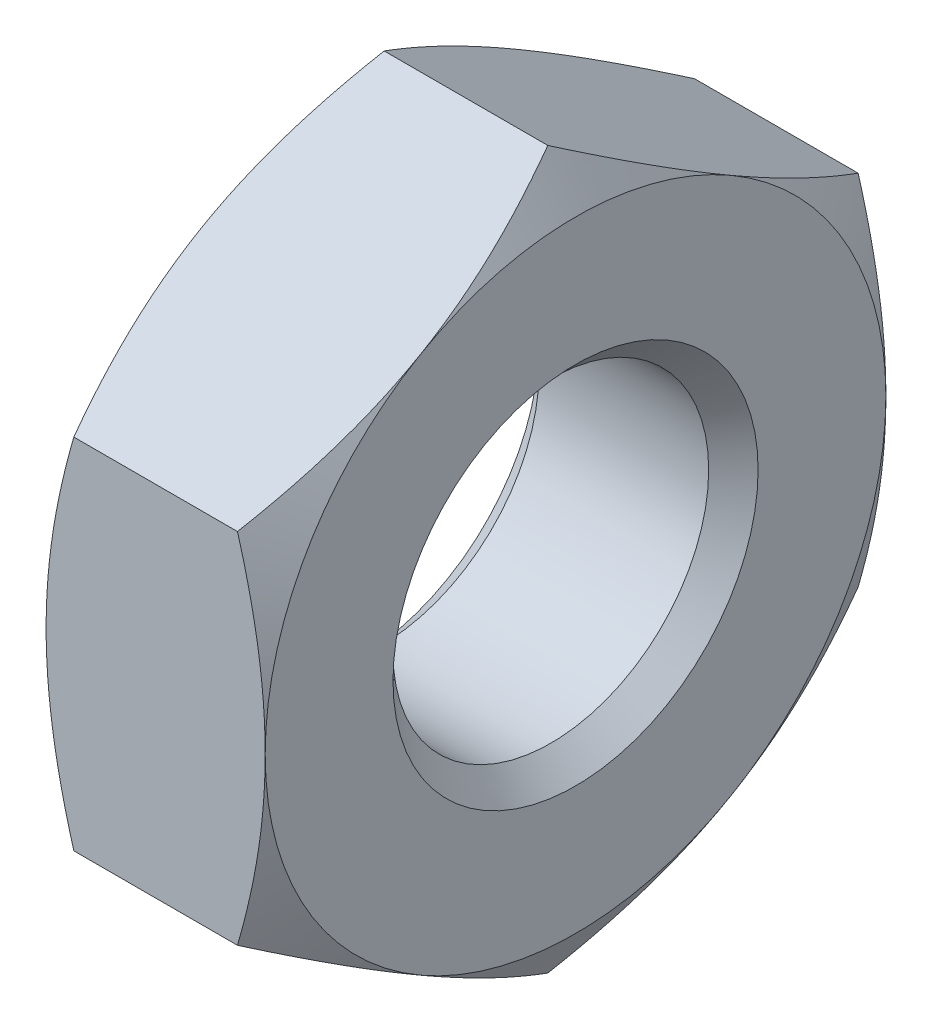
ISO-10303-21;
HEADER;
FILE_DESCRIPTION(('STEP AP214'),'2;1');
FILE_NAME('part.step','',(''),(''),'','','');
FILE_SCHEMA(('AUTOMOTIVE_DESIGN { 1 0 10303 214 1 1 1 1 }'));
ENDSEC;
DATA;
#1=APPLICATION_CONTEXT('core data for automotive mechanical design processes');
#2=APPLICATION_PROTOCOL_DEFINITION('international standard','automotive_design',2000,#1);
#3=PRODUCT_CONTEXT('',#1,'mechanical');
#4=PRODUCT('Part','Part','',(#3));
#5=PRODUCT_RELATED_PRODUCT_CATEGORY('part','',(#4));
#6=PRODUCT_DEFINITION_FORMATION('','',#4);
#7=PRODUCT_DEFINITION_CONTEXT('part definition',#1,'design');
#8=PRODUCT_DEFINITION('design','',#6,#7);
#9=PRODUCT_DEFINITION_SHAPE('','',#8);
#10=(LENGTH_UNIT() NAMED_UNIT(*) SI_UNIT(.MILLI.,.METRE.));
#11=(NAMED_UNIT(*) PLANE_ANGLE_UNIT() SI_UNIT($,.RADIAN.));
#12=(NAMED_UNIT(*) SI_UNIT($,.STERADIAN.) SOLID_ANGLE_UNIT());
#13=UNCERTAINTY_MEASURE_WITH_UNIT(LENGTH_MEASURE(1.E-05),#10,'distance_accuracy_value','');
#14=(GEOMETRIC_REPRESENTATION_CONTEXT(3) GLOBAL_UNCERTAINTY_ASSIGNED_CONTEXT((#13)) GLOBAL_UNIT_ASSIGNED_CONTEXT((#10,
#11,#12)) REPRESENTATION_CONTEXT('',''));
#15=CARTESIAN_POINT('',(0.,0.,0.));
#16=DIRECTION('',(0.,0.,1.));
#17=DIRECTION('',(1.,0.,0.));
#18=AXIS2_PLACEMENT_3D('',#15,#16,#17);
#19=CARTESIAN_POINT('',(-2.01850454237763,0.,0.));
#20=DIRECTION('',(1.,0.,0.));
#21=DIRECTION('',(0.,0.,-1.));
#22=AXIS2_PLACEMENT_3D('',#19,#20,#21);
#23=CONICAL_SURFACE('',#22,10.2,1.0471975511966);
#24=CARTESIAN_POINT('',(1.08239963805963,-13.0462125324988,-8.5));
#25=CARTESIAN_POINT('',(0.903402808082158,-12.6760798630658,-8.5));
#26=CARTESIAN_POINT('',(0.726162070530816,-12.3050827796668,-8.5));
#27=CARTESIAN_POINT('',(0.37618329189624,-11.5608995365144,-8.5));
#28=CARTESIAN_POINT('',(0.203445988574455,-11.1877130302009,-8.5));
#29=CARTESIAN_POINT('',(-0.137433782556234,-10.4367018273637,-8.5));
#30=CARTESIAN_POINT('',(-0.305544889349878,-10.0588628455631,-8.5));
#31=CARTESIAN_POINT('',(-0.634703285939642,-9.30013174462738,-8.5));
#32=CARTESIAN_POINT('',(-0.795750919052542,-8.91923977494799,-8.5));
#33=CARTESIAN_POINT('',(-1.11372395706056,-8.14203709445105,-8.5));
#34=CARTESIAN_POINT('',(-1.27037118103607,-7.74561192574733,-8.5));
#35=CARTESIAN_POINT('',(-1.5714775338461,-6.94807471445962,-8.5));
#36=CARTESIAN_POINT('',(-1.71593527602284,-6.54696214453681,-8.5));
#37=CARTESIAN_POINT('',(-1.98876984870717,-5.74020294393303,-8.5));
#38=CARTESIAN_POINT('',(-2.11718044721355,-5.33456785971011,-8.5));
#39=CARTESIAN_POINT('',(-2.35371296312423,-4.51749645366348,-8.5));
#40=CARTESIAN_POINT('',(-2.46184141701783,-4.10606204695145,-8.5));
#41=CARTESIAN_POINT('',(-2.65195658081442,-3.27934683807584,-8.5));
#42=CARTESIAN_POINT('',(-2.73407986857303,-2.86409832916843,-8.5));
#43=CARTESIAN_POINT('',(-2.83413907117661,-2.23755533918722,-8.5));
#44=CARTESIAN_POINT('',(-2.86363924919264,-2.02807949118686,-8.5));
#45=CARTESIAN_POINT('',(-2.91434957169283,-1.60813347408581,-8.5));
#46=CARTESIAN_POINT('',(-2.93556051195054,-1.39766340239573,-8.5));
#47=CARTESIAN_POINT('',(-2.96901070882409,-0.978699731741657,-8.5));
#48=CARTESIAN_POINT('',(-2.98136051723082,-0.770214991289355,-8.5));
#49=CARTESIAN_POINT('',(-2.99724292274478,-0.35291057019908,-8.5));
#50=CARTESIAN_POINT('',(-3.00077566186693,-0.14409089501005,-8.5));
#51=CARTESIAN_POINT('',(-2.99893991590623,0.273511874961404,-8.5));
#52=CARTESIAN_POINT('',(-2.99357135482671,0.482294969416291,-8.5));
#53=CARTESIAN_POINT('',(-2.97406159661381,0.899453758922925,-8.5));
#54=CARTESIAN_POINT('',(-2.95991996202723,1.10782943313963,-8.5));
#55=CARTESIAN_POINT('',(-2.91531216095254,1.61281865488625,-8.5));
#56=CARTESIAN_POINT('',(-2.88045071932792,1.90905045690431,-8.5));
#57=CARTESIAN_POINT('',(-2.79492946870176,2.49922657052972,-8.5));
#58=CARTESIAN_POINT('',(-2.74426739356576,2.79317054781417,-8.5));
#59=CARTESIAN_POINT('',(-2.62894743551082,3.37852184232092,-8.5));
#60=CARTESIAN_POINT('',(-2.56427821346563,3.66992690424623,-8.5));
#61=CARTESIAN_POINT('',(-2.42290936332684,4.2497709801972,-8.5));
#62=CARTESIAN_POINT('',(-2.34620995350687,4.53821004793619,-8.5));
#63=CARTESIAN_POINT('',(-2.18085440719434,5.11836420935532,-8.5));
#64=CARTESIAN_POINT('',(-2.0919757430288,5.41001544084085,-8.5));
#65=CARTESIAN_POINT('',(-1.90532998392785,5.99044389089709,-8.5));
#66=CARTESIAN_POINT('',(-1.8075628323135,6.27922109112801,-8.5));
#67=CARTESIAN_POINT('',(-1.60466641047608,6.85404914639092,-8.5));
#68=CARTESIAN_POINT('',(-1.49953978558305,7.14010093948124,-8.5));
#69=CARTESIAN_POINT('',(-1.28313214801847,7.7098543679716,-8.5));
#70=CARTESIAN_POINT('',(-1.1718511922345,7.99355602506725,-8.5));
#71=CARTESIAN_POINT('',(-0.912449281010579,8.63761346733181,-8.5));
#72=CARTESIAN_POINT('',(-0.762699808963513,8.99731216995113,-8.5));
#73=CARTESIAN_POINT('',(-0.456504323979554,9.71385543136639,-8.5));
#74=CARTESIAN_POINT('',(-0.30005798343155,10.0706998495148,-8.5));
#75=CARTESIAN_POINT('',(0.0182565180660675,10.7820346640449,-8.5));
#76=CARTESIAN_POINT('',(0.180125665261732,11.1365246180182,-8.5));
#77=CARTESIAN_POINT('',(0.50824875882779,11.8434580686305,-8.5));
#78=CARTESIAN_POINT('',(0.674502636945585,12.1959015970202,-8.5));
#79=CARTESIAN_POINT('',(1.01076024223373,12.8993735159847,-8.5));
#80=CARTESIAN_POINT('',(1.18076713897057,13.2504003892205,-8.5));
#81=CARTESIAN_POINT('',(1.52377741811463,13.9509882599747,-8.5));
#82=CARTESIAN_POINT('',(1.69678082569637,14.3005492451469,-8.5));
#83=CARTESIAN_POINT('',(2.21953102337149,15.347382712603,-8.5));
#84=CARTESIAN_POINT('',(2.5730111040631,16.0427918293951,-8.5));
#85=CARTESIAN_POINT('',(3.09465466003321,17.0561246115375,-8.5));
#86=CARTESIAN_POINT('',(3.26001892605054,17.3754981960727,-8.5));
#87=CARTESIAN_POINT('',(3.59207124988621,18.0135502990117,-8.5));
#88=CARTESIAN_POINT('',(3.75875928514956,18.3322288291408,-8.5));
#89=CARTESIAN_POINT('',(4.26055818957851,19.2873817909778,-8.5));
#90=CARTESIAN_POINT('',(4.59739214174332,19.9229508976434,-8.5));
#91=CARTESIAN_POINT('',(5.273843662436,21.190807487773,-8.5));
#92=CARTESIAN_POINT('',(5.61345347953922,21.8230991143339,-8.5));
#93=CARTESIAN_POINT('',(6.29546476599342,23.0861357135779,-8.5));
#94=CARTESIAN_POINT('',(6.63786609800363,23.7168807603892,-8.5));
#95=CARTESIAN_POINT('',(6.98131927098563,24.3470488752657,-8.5));
#96=B_SPLINE_CURVE_WITH_KNOTS('',3,(#24,#25,#26,#27,#28,#29,#30,#31,#32,#33,#34,#35,#36,#37,#38,
#39,#40,#41,#42,#43,#44,#45,#46,#47,#48,#49,#50,#51,#52,#53,#54,#55,#56,#57,#58,#59,#60,#61,#62,
#63,#64,#65,#66,#67,#68,#69,#70,#71,#72,#73,#74,#75,#76,#77,#78,#79,#80,#81,#82,#83,#84,#85,#86,
#87,#88,#89,#90,#91,#92,#93,#94,#95),.UNSPECIFIED.,.F.,.F.,(4,2,2,2,2,2,2,2,2,2,2,2,2,2,2,2,2,2,
2,2,2,2,2,2,2,2,2,2,2,2,2,2,2,2,2,4),(0.,1.23344288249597,2.46708657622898,3.70767886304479,
4.94821078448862,6.22681310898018,7.50556068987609,8.78157039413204,10.0571681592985,
11.3259509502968,11.9604413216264,12.5948707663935,13.2212405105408,13.8476001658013,
14.4739651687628,15.1003614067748,15.9946915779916,16.8891500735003,17.7843353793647,
18.679504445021,19.5940140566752,20.5085295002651,21.4227178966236,22.3368978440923,
23.5056849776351,24.6745293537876,25.8435874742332,27.0126274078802,28.1826955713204,
29.3527735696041,31.6929757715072,32.7719109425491,33.8508277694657,36.0087380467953,
38.1619023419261,40.3149613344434),.UNSPECIFIED.);
#97=CARTESIAN_POINT('',(-2.24081062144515,-4.90747728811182,-8.5));
#98=VERTEX_POINT('',#97);
#99=CARTESIAN_POINT('',(-3.,0.,-8.5));
#100=VERTEX_POINT('',#99);
#101=EDGE_CURVE('E333',#98,#100,#96,.T.);
#102=ORIENTED_EDGE('',*,*,#101,.F.);
#103=CARTESIAN_POINT('',(-2.24074395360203,-9.81507004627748,0.000200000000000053));
#104=CARTESIAN_POINT('',(-2.30301386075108,-9.70719836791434,-0.186639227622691));
#105=CARTESIAN_POINT('',(-2.36245770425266,-9.59892450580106,-0.374175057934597));
#106=CARTESIAN_POINT('',(-2.47491488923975,-9.3814974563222,-0.750769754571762));
#107=CARTESIAN_POINT('',(-2.52792545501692,-9.27234391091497,-0.939829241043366));
#108=CARTESIAN_POINT('',(-2.67626661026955,-8.94313560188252,-1.5100347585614));
#109=CARTESIAN_POINT('',(-2.76064107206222,-8.72178130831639,-1.89343164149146));
#110=CARTESIAN_POINT('',(-2.85957998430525,-8.39052888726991,-2.46717766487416));
#111=CARTESIAN_POINT('',(-2.88776480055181,-8.28162036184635,-2.65581276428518));
#112=CARTESIAN_POINT('',(-2.9350259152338,-8.06331079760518,-3.03393602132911));
#113=CARTESIAN_POINT('',(-2.95410301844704,-7.95390980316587,-3.22342410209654));
#114=CARTESIAN_POINT('',(-2.9826652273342,-7.73491944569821,-3.6027265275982));
#115=CARTESIAN_POINT('',(-2.99216121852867,-7.62533043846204,-3.79254025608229));
#116=CARTESIAN_POINT('',(-3.00135762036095,-7.40605119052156,-4.17234305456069));
#117=CARTESIAN_POINT('',(-3.00105833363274,-7.29636095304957,-4.36233211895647));
#118=CARTESIAN_POINT('',(-2.9913455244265,-7.09129139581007,-4.71752301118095));
#119=CARTESIAN_POINT('',(-2.98311683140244,-6.99589760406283,-4.8827499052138));
#120=CARTESIAN_POINT('',(-2.95941075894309,-6.80533344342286,-5.21281671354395));
#121=CARTESIAN_POINT('',(-2.9439328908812,-6.71016309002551,-5.37765660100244));
#122=CARTESIAN_POINT('',(-2.88699137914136,-6.42502047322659,-5.87153810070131));
#123=CARTESIAN_POINT('',(-2.83502693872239,-6.23555293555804,-6.19970550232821));
#124=CARTESIAN_POINT('',(-2.70511505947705,-5.8546080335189,-6.85952142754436));
#125=CARTESIAN_POINT('',(-2.62661693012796,-5.66317928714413,-7.19108574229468));
#126=CARTESIAN_POINT('',(-2.44845866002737,-5.28317649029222,-7.84926989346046));
#127=CARTESIAN_POINT('',(-2.34884036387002,-5.09459757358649,-8.17589815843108));
#128=CARTESIAN_POINT('',(-2.24074395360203,-4.90736181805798,-8.5002));
#129=B_SPLINE_CURVE_WITH_KNOTS('',3,(#103,#104,#105,#106,#107,#108,#109,#110,#111,#112,#113,
#114,#115,#116,#117,#118,#119,#120,#121,#122,#123,#124,#125,#126,#127,#128),.UNSPECIFIED.,.F.,
.F.,(4,2,2,2,2,2,2,2,2,2,2,2,4),(0.,0.673596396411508,1.34748239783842,2.69805431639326,
3.356799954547,4.01548737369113,4.67342558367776,5.33134346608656,5.9040955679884,
6.47688628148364,7.62328361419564,8.79510569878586,9.9646274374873),.UNSPECIFIED.);
#130=CARTESIAN_POINT('',(-3.,-7.36121593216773,-4.25));
#131=VERTEX_POINT('',#130);
#132=EDGE_CURVE('E168',#131,#98,#129,.T.);
#133=ORIENTED_EDGE('',*,*,#132,.F.);
#134=CARTESIAN_POINT('',(-3.,0.,0.));
#135=DIRECTION('',(-1.,0.,0.));
#136=DIRECTION('',(0.,0.,1.));
#137=AXIS2_PLACEMENT_3D('',#134,#135,#136);
#138=CIRCLE('',#137,8.5);
#139=EDGE_CURVE('E324',#100,#131,#138,.T.);
#140=ORIENTED_EDGE('',*,*,#139,.F.);
#141=EDGE_LOOP('',(#102,#133,#140));
#142=FACE_BOUND('',#141,.T.);
#143=ADVANCED_FACE('F16',(#142),#23,.T.);
#144=CARTESIAN_POINT('',(-2.24081062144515,4.90747728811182,-8.5));
#145=VERTEX_POINT('',#144);
#146=EDGE_CURVE('E176',#100,#145,#96,.T.);
#147=ORIENTED_EDGE('',*,*,#146,.F.);
#148=CARTESIAN_POINT('',(-3.,7.36121593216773,-4.25));
#149=VERTEX_POINT('',#148);
#150=EDGE_CURVE('E325',#149,#100,#138,.T.);
#151=ORIENTED_EDGE('',*,*,#150,.F.);
#152=CARTESIAN_POINT('',(-2.24074395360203,4.90736181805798,-8.5002));
#153=CARTESIAN_POINT('',(-2.30301386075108,5.01523349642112,-8.31336077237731));
#154=CARTESIAN_POINT('',(-2.36245770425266,5.1235073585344,-8.1258249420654));
#155=CARTESIAN_POINT('',(-2.47491488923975,5.34093440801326,-7.74923024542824));
#156=CARTESIAN_POINT('',(-2.52792545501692,5.45008795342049,-7.56017075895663));
#157=CARTESIAN_POINT('',(-2.67626661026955,5.77929626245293,-6.9899652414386));
#158=CARTESIAN_POINT('',(-2.76064107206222,6.00065055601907,-6.60656835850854));
#159=CARTESIAN_POINT('',(-2.85957998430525,6.33190297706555,-6.03282233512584));
#160=CARTESIAN_POINT('',(-2.8877648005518,6.44081150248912,-5.84418723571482));
#161=CARTESIAN_POINT('',(-2.9350259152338,6.65912106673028,-5.46606397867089));
#162=CARTESIAN_POINT('',(-2.95410301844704,6.76852206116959,-5.27657589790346));
#163=CARTESIAN_POINT('',(-2.9826652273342,6.98751241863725,-4.8972734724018));
#164=CARTESIAN_POINT('',(-2.99216121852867,7.09710142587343,-4.70745974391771));
#165=CARTESIAN_POINT('',(-3.00135762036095,7.3163806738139,-4.32765694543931));
#166=CARTESIAN_POINT('',(-3.00105833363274,7.42607091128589,-4.13766788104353));
#167=CARTESIAN_POINT('',(-2.9913455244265,7.63114046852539,-3.78247698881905));
#168=CARTESIAN_POINT('',(-2.98311683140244,7.72653426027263,-3.6172500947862));
#169=CARTESIAN_POINT('',(-2.95941075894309,7.9170984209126,-3.28718328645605));
#170=CARTESIAN_POINT('',(-2.9439328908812,8.01226877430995,-3.12234339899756));
#171=CARTESIAN_POINT('',(-2.88699137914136,8.29741139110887,-2.62846189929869));
#172=CARTESIAN_POINT('',(-2.83502693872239,8.48687892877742,-2.30029449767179));
#173=CARTESIAN_POINT('',(-2.70511505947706,8.86782383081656,-1.64047857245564));
#174=CARTESIAN_POINT('',(-2.62661693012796,9.05925257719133,-1.30891425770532));
#175=CARTESIAN_POINT('',(-2.44845866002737,9.43925537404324,-0.650730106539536));
#176=CARTESIAN_POINT('',(-2.34884036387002,9.62783429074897,-0.32410184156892));
#177=CARTESIAN_POINT('',(-2.24074395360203,9.81507004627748,0.000200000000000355));
#178=B_SPLINE_CURVE_WITH_KNOTS('',3,(#152,#153,#154,#155,#156,#157,#158,#159,#160,#161,#162,
#163,#164,#165,#166,#167,#168,#169,#170,#171,#172,#173,#174,#175,#176,#177),.UNSPECIFIED.,.F.,
.F.,(4,2,2,2,2,2,2,2,2,2,2,2,4),(0.,0.673596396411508,1.34748239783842,2.69805431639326,
3.356799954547,4.01548737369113,4.67342558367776,5.33134346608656,5.9040955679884,
6.47688628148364,7.62328361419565,8.79510569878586,9.96462743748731),.UNSPECIFIED.);
#179=EDGE_CURVE('E191',#145,#149,#178,.T.);
#180=ORIENTED_EDGE('',*,*,#179,.F.);
#181=EDGE_LOOP('',(#147,#151,#180));
#182=FACE_BOUND('',#181,.T.);
#183=ADVANCED_FACE('F150',(#182),#23,.T.);
#184=CARTESIAN_POINT('',(-2.24081062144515,9.81495457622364,0.));
#185=VERTEX_POINT('',#184);
#186=EDGE_CURVE('E184',#149,#185,#178,.T.);
#187=ORIENTED_EDGE('',*,*,#186,.F.);
#188=CARTESIAN_POINT('',(-3.,7.36121593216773,4.25));
#189=VERTEX_POINT('',#188);
#190=EDGE_CURVE('E24',#189,#149,#138,.T.);
#191=ORIENTED_EDGE('',*,*,#190,.F.);
#192=CARTESIAN_POINT('',(-2.24074395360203,9.81507004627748,-0.000200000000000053));
#193=CARTESIAN_POINT('',(-2.30301386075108,9.70719836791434,0.186639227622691));
#194=CARTESIAN_POINT('',(-2.36245770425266,9.59892450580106,0.374175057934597));
#195=CARTESIAN_POINT('',(-2.47491488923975,9.3814974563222,0.750769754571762));
#196=CARTESIAN_POINT('',(-2.52792545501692,9.27234391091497,0.939829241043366));
#197=CARTESIAN_POINT('',(-2.67626661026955,8.94313560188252,1.5100347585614));
#198=CARTESIAN_POINT('',(-2.76064107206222,8.72178130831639,1.89343164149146));
#199=CARTESIAN_POINT('',(-2.85957998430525,8.39052888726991,2.46717766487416));
#200=CARTESIAN_POINT('',(-2.88776480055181,8.28162036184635,2.65581276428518));
#201=CARTESIAN_POINT('',(-2.9350259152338,8.06331079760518,3.03393602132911));
#202=CARTESIAN_POINT('',(-2.95410301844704,7.95390980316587,3.22342410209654));
#203=CARTESIAN_POINT('',(-2.9826652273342,7.73491944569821,3.6027265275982));
#204=CARTESIAN_POINT('',(-2.99216121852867,7.62533043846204,3.79254025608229));
#205=CARTESIAN_POINT('',(-3.00135762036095,7.40605119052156,4.17234305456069));
#206=CARTESIAN_POINT('',(-3.00105833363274,7.29636095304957,4.36233211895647));
#207=CARTESIAN_POINT('',(-2.9913455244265,7.09129139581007,4.71752301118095));
#208=CARTESIAN_POINT('',(-2.98311683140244,6.99589760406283,4.8827499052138));
#209=CARTESIAN_POINT('',(-2.95941075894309,6.80533344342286,5.21281671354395));
#210=CARTESIAN_POINT('',(-2.9439328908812,6.71016309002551,5.37765660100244));
#211=CARTESIAN_POINT('',(-2.88699137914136,6.42502047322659,5.87153810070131));
#212=CARTESIAN_POINT('',(-2.83502693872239,6.23555293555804,6.19970550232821));
#213=CARTESIAN_POINT('',(-2.70511505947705,5.8546080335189,6.85952142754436));
#214=CARTESIAN_POINT('',(-2.62661693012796,5.66317928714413,7.19108574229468));
#215=CARTESIAN_POINT('',(-2.44845866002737,5.28317649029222,7.84926989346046));
#216=CARTESIAN_POINT('',(-2.34884036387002,5.09459757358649,8.17589815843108));
#217=CARTESIAN_POINT('',(-2.24074395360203,4.90736181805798,8.5002));
#218=B_SPLINE_CURVE_WITH_KNOTS('',3,(#192,#193,#194,#195,#196,#197,#198,#199,#200,#201,#202,
#203,#204,#205,#206,#207,#208,#209,#210,#211,#212,#213,#214,#215,#216,#217),.UNSPECIFIED.,.F.,
.F.,(4,2,2,2,2,2,2,2,2,2,2,2,4),(0.,0.673596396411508,1.34748239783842,2.69805431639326,
3.356799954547,4.01548737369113,4.67342558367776,5.33134346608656,5.9040955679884,
6.47688628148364,7.62328361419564,8.79510569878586,9.9646274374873),.UNSPECIFIED.);
#219=EDGE_CURVE('E113',#185,#189,#218,.T.);
#220=ORIENTED_EDGE('',*,*,#219,.F.);
#221=EDGE_LOOP('',(#187,#191,#220));
#222=FACE_BOUND('',#221,.T.);
#223=ADVANCED_FACE('F338',(#222),#23,.T.);
#224=CARTESIAN_POINT('',(-2.24081062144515,-9.81495457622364,0.));
#225=VERTEX_POINT('',#224);
#226=EDGE_CURVE('E221',#225,#131,#129,.T.);
#227=ORIENTED_EDGE('',*,*,#226,.F.);
#228=CARTESIAN_POINT('',(-2.24074395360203,-4.90736181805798,8.5002));
#229=CARTESIAN_POINT('',(-2.30301386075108,-5.01523349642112,8.31336077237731));
#230=CARTESIAN_POINT('',(-2.36245770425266,-5.1235073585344,8.1258249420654));
#231=CARTESIAN_POINT('',(-2.47491488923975,-5.34093440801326,7.74923024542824));
#232=CARTESIAN_POINT('',(-2.52792545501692,-5.45008795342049,7.56017075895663));
#233=CARTESIAN_POINT('',(-2.67626661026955,-5.77929626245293,6.9899652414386));
#234=CARTESIAN_POINT('',(-2.76064107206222,-6.00065055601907,6.60656835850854));
#235=CARTESIAN_POINT('',(-2.85957998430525,-6.33190297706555,6.03282233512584));
#236=CARTESIAN_POINT('',(-2.8877648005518,-6.44081150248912,5.84418723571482));
#237=CARTESIAN_POINT('',(-2.9350259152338,-6.65912106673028,5.46606397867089));
#238=CARTESIAN_POINT('',(-2.95410301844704,-6.76852206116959,5.27657589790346));
#239=CARTESIAN_POINT('',(-2.9826652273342,-6.98751241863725,4.8972734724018));
#240=CARTESIAN_POINT('',(-2.99216121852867,-7.09710142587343,4.70745974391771));
#241=CARTESIAN_POINT('',(-3.00135762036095,-7.3163806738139,4.32765694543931));
#242=CARTESIAN_POINT('',(-3.00105833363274,-7.42607091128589,4.13766788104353));
#243=CARTESIAN_POINT('',(-2.9913455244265,-7.63114046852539,3.78247698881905));
#244=CARTESIAN_POINT('',(-2.98311683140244,-7.72653426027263,3.6172500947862));
#245=CARTESIAN_POINT('',(-2.95941075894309,-7.9170984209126,3.28718328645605));
#246=CARTESIAN_POINT('',(-2.9439328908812,-8.01226877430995,3.12234339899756));
#247=CARTESIAN_POINT('',(-2.88699137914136,-8.29741139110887,2.62846189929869));
#248=CARTESIAN_POINT('',(-2.83502693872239,-8.48687892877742,2.30029449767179));
#249=CARTESIAN_POINT('',(-2.70511505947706,-8.86782383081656,1.64047857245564));
#250=CARTESIAN_POINT('',(-2.62661693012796,-9.05925257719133,1.30891425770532));
#251=CARTESIAN_POINT('',(-2.44845866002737,-9.43925537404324,0.650730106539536));
#252=CARTESIAN_POINT('',(-2.34884036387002,-9.62783429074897,0.32410184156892));
#253=CARTESIAN_POINT('',(-2.24074395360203,-9.81507004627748,-0.000200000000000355));
#254=B_SPLINE_CURVE_WITH_KNOTS('',3,(#228,#229,#230,#231,#232,#233,#234,#235,#236,#237,#238,
#239,#240,#241,#242,#243,#244,#245,#246,#247,#248,#249,#250,#251,#252,#253),.UNSPECIFIED.,.F.,
.F.,(4,2,2,2,2,2,2,2,2,2,2,2,4),(0.,0.673596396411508,1.34748239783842,2.69805431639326,
3.356799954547,4.01548737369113,4.67342558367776,5.33134346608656,5.9040955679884,
6.47688628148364,7.62328361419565,8.79510569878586,9.96462743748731),.UNSPECIFIED.);
#255=CARTESIAN_POINT('',(-3.,-7.36121593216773,4.25));
#256=VERTEX_POINT('',#255);
#257=EDGE_CURVE('E160',#256,#225,#254,.T.);
#258=ORIENTED_EDGE('',*,*,#257,.F.);
#259=EDGE_CURVE('E322',#131,#256,#138,.T.);
#260=ORIENTED_EDGE('',*,*,#259,.F.);
#261=EDGE_LOOP('',(#227,#258,#260));
#262=FACE_BOUND('',#261,.T.);
#263=ADVANCED_FACE('F336',(#262),#23,.T.);
#264=CARTESIAN_POINT('',(-2.24081062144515,4.90747728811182,8.5));
#265=VERTEX_POINT('',#264);
#266=EDGE_CURVE('E107',#189,#265,#218,.T.);
#267=ORIENTED_EDGE('',*,*,#266,.F.);
#268=CARTESIAN_POINT('',(-3.,0.,8.5));
#269=VERTEX_POINT('',#268);
#270=EDGE_CURVE('E11',#269,#189,#138,.T.);
#271=ORIENTED_EDGE('',*,*,#270,.F.);
#272=CARTESIAN_POINT('',(1.08239963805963,-13.0462125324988,8.5));
#273=CARTESIAN_POINT('',(0.903402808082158,-12.6760798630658,8.5));
#274=CARTESIAN_POINT('',(0.726162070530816,-12.3050827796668,8.5));
#275=CARTESIAN_POINT('',(0.37618329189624,-11.5608995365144,8.5));
#276=CARTESIAN_POINT('',(0.203445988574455,-11.1877130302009,8.5));
#277=CARTESIAN_POINT('',(-0.137433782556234,-10.4367018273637,8.5));
#278=CARTESIAN_POINT('',(-0.305544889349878,-10.0588628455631,8.5));
#279=CARTESIAN_POINT('',(-0.634703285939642,-9.30013174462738,8.5));
#280=CARTESIAN_POINT('',(-0.795750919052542,-8.91923977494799,8.5));
#281=CARTESIAN_POINT('',(-1.11372395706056,-8.14203709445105,8.5));
#282=CARTESIAN_POINT('',(-1.27037118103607,-7.74561192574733,8.5));
#283=CARTESIAN_POINT('',(-1.5714775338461,-6.94807471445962,8.5));
#284=CARTESIAN_POINT('',(-1.71593527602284,-6.54696214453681,8.5));
#285=CARTESIAN_POINT('',(-1.98876984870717,-5.74020294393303,8.5));
#286=CARTESIAN_POINT('',(-2.11718044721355,-5.33456785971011,8.5));
#287=CARTESIAN_POINT('',(-2.35371296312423,-4.51749645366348,8.5));
#288=CARTESIAN_POINT('',(-2.46184141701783,-4.10606204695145,8.5));
#289=CARTESIAN_POINT('',(-2.65195658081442,-3.27934683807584,8.5));
#290=CARTESIAN_POINT('',(-2.73407986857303,-2.86409832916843,8.5));
#291=CARTESIAN_POINT('',(-2.83413907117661,-2.23755533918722,8.5));
#292=CARTESIAN_POINT('',(-2.86363924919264,-2.02807949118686,8.5));
#293=CARTESIAN_POINT('',(-2.91434957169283,-1.60813347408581,8.5));
#294=CARTESIAN_POINT('',(-2.93556051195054,-1.39766340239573,8.5));
#295=CARTESIAN_POINT('',(-2.96901070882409,-0.978699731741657,8.5));
#296=CARTESIAN_POINT('',(-2.98136051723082,-0.770214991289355,8.5));
#297=CARTESIAN_POINT('',(-2.99724292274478,-0.35291057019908,8.5));
#298=CARTESIAN_POINT('',(-3.00077566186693,-0.14409089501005,8.5));
#299=CARTESIAN_POINT('',(-2.99893991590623,0.273511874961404,8.5));
#300=CARTESIAN_POINT('',(-2.99357135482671,0.482294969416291,8.5));
#301=CARTESIAN_POINT('',(-2.97406159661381,0.899453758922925,8.5));
#302=CARTESIAN_POINT('',(-2.95991996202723,1.10782943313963,8.5));
#303=CARTESIAN_POINT('',(-2.91531216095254,1.61281865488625,8.5));
#304=CARTESIAN_POINT('',(-2.88045071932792,1.90905045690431,8.5));
#305=CARTESIAN_POINT('',(-2.79492946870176,2.49922657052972,8.5));
#306=CARTESIAN_POINT('',(-2.74426739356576,2.79317054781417,8.5));
#307=CARTESIAN_POINT('',(-2.62894743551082,3.37852184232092,8.5));
#308=CARTESIAN_POINT('',(-2.56427821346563,3.66992690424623,8.5));
#309=CARTESIAN_POINT('',(-2.42290936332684,4.2497709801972,8.5));
#310=CARTESIAN_POINT('',(-2.34620995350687,4.53821004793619,8.5));
#311=CARTESIAN_POINT('',(-2.18085440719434,5.11836420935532,8.5));
#312=CARTESIAN_POINT('',(-2.0919757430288,5.41001544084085,8.5));
#313=CARTESIAN_POINT('',(-1.90532998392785,5.99044389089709,8.5));
#314=CARTESIAN_POINT('',(-1.8075628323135,6.27922109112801,8.5));
#315=CARTESIAN_POINT('',(-1.60466641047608,6.85404914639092,8.5));
#316=CARTESIAN_POINT('',(-1.49953978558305,7.14010093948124,8.5));
#317=CARTESIAN_POINT('',(-1.28313214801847,7.7098543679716,8.5));
#318=CARTESIAN_POINT('',(-1.1718511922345,7.99355602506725,8.5));
#319=CARTESIAN_POINT('',(-0.912449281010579,8.63761346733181,8.5));
#320=CARTESIAN_POINT('',(-0.762699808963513,8.99731216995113,8.5));
#321=CARTESIAN_POINT('',(-0.456504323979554,9.71385543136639,8.5));
#322=CARTESIAN_POINT('',(-0.30005798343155,10.0706998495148,8.5));
#323=CARTESIAN_POINT('',(0.0182565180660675,10.7820346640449,8.5));
#324=CARTESIAN_POINT('',(0.180125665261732,11.1365246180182,8.5));
#325=CARTESIAN_POINT('',(0.50824875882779,11.8434580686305,8.5));
#326=CARTESIAN_POINT('',(0.674502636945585,12.1959015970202,8.5));
#327=CARTESIAN_POINT('',(1.01076024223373,12.8993735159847,8.5));
#328=CARTESIAN_POINT('',(1.18076713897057,13.2504003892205,8.5));
#329=CARTESIAN_POINT('',(1.52377741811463,13.9509882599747,8.5));
#330=CARTESIAN_POINT('',(1.69678082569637,14.3005492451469,8.5));
#331=CARTESIAN_POINT('',(2.21953102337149,15.347382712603,8.5));
#332=CARTESIAN_POINT('',(2.5730111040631,16.0427918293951,8.5));
#333=CARTESIAN_POINT('',(3.09465466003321,17.0561246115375,8.5));
#334=CARTESIAN_POINT('',(3.26001892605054,17.3754981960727,8.5));
#335=CARTESIAN_POINT('',(3.59207124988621,18.0135502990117,8.5));
#336=CARTESIAN_POINT('',(3.75875928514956,18.3322288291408,8.5));
#337=CARTESIAN_POINT('',(4.26055818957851,19.2873817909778,8.5));
#338=CARTESIAN_POINT('',(4.59739214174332,19.9229508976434,8.5));
#339=CARTESIAN_POINT('',(5.273843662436,21.190807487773,8.5));
#340=CARTESIAN_POINT('',(5.61345347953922,21.8230991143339,8.5));
#341=CARTESIAN_POINT('',(6.29546476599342,23.0861357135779,8.5));
#342=CARTESIAN_POINT('',(6.63786609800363,23.7168807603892,8.5));
#343=CARTESIAN_POINT('',(6.98131927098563,24.3470488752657,8.5));
#344=B_SPLINE_CURVE_WITH_KNOTS('',3,(#272,#273,#274,#275,#276,#277,#278,#279,#280,#281,#282,
#283,#284,#285,#286,#287,#288,#289,#290,#291,#292,#293,#294,#295,#296,#297,#298,#299,#300,#301,
#302,#303,#304,#305,#306,#307,#308,#309,#310,#311,#312,#313,#314,#315,#316,#317,#318,#319,#320,
#321,#322,#323,#324,#325,#326,#327,#328,#329,#330,#331,#332,#333,#334,#335,#336,#337,#338,#339,
#340,#341,#342,#343),.UNSPECIFIED.,.F.,.F.,(4,2,2,2,2,2,2,2,2,2,2,2,2,2,2,2,2,2,2,2,2,2,2,2,2,2,
2,2,2,2,2,2,2,2,2,4),(0.,1.23344288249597,2.46708657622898,3.70767886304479,4.94821078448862,
6.22681310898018,7.50556068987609,8.78157039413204,10.0571681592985,11.3259509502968,
11.9604413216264,12.5948707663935,13.2212405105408,13.8476001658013,14.4739651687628,
15.1003614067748,15.9946915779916,16.8891500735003,17.7843353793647,18.679504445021,
19.5940140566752,20.5085295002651,21.4227178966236,22.3368978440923,23.5056849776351,
24.6745293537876,25.8435874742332,27.0126274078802,28.1826955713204,29.3527735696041,
31.6929757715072,32.7719109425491,33.8508277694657,36.0087380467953,38.1619023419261,
40.3149613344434),.UNSPECIFIED.);
#345=EDGE_CURVE('E32',#265,#269,#344,.F.);
#346=ORIENTED_EDGE('',*,*,#345,.F.);
#347=EDGE_LOOP('',(#267,#271,#346));
#348=FACE_BOUND('',#347,.T.);
#349=ADVANCED_FACE('F123',(#348),#23,.T.);
#350=CARTESIAN_POINT('',(-2.24081062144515,-4.90747728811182,8.5));
#351=VERTEX_POINT('',#350);
#352=EDGE_CURVE('E233',#351,#256,#254,.T.);
#353=ORIENTED_EDGE('',*,*,#352,.F.);
#354=EDGE_CURVE('E125',#269,#351,#344,.F.);
#355=ORIENTED_EDGE('',*,*,#354,.F.);
#356=EDGE_CURVE('E25',#256,#269,#138,.T.);
#357=ORIENTED_EDGE('',*,*,#356,.F.);
#358=EDGE_LOOP('',(#353,#355,#357));
#359=FACE_BOUND('',#358,.T.);
#360=ADVANCED_FACE('F152',(#359),#23,.T.);
#361=CARTESIAN_POINT('',(3.,0.,0.));
#362=DIRECTION('',(-1.,0.,0.));
#363=DIRECTION('',(0.,0.,1.));
#364=AXIS2_PLACEMENT_3D('',#361,#362,#363);
#365=CONICAL_SURFACE('',#364,8.5,1.0471975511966);
#366=CARTESIAN_POINT('',(2.24074395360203,4.90736181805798,8.5002));
#367=CARTESIAN_POINT('',(2.30301386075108,5.01523349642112,8.31336077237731));
#368=CARTESIAN_POINT('',(2.36245770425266,5.1235073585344,8.1258249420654));
#369=CARTESIAN_POINT('',(2.47491488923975,5.34093440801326,7.74923024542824));
#370=CARTESIAN_POINT('',(2.52792545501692,5.45008795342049,7.56017075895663));
#371=CARTESIAN_POINT('',(2.67626661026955,5.77929626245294,6.9899652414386));
#372=CARTESIAN_POINT('',(2.76064107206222,6.00065055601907,6.60656835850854));
#373=CARTESIAN_POINT('',(2.85957998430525,6.33190297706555,6.03282233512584));
#374=CARTESIAN_POINT('',(2.8877648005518,6.44081150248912,5.84418723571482));
#375=CARTESIAN_POINT('',(2.9350259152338,6.65912106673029,5.46606397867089));
#376=CARTESIAN_POINT('',(2.95410301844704,6.76852206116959,5.27657589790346));
#377=CARTESIAN_POINT('',(2.9826652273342,6.98751241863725,4.8972734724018));
#378=CARTESIAN_POINT('',(2.99216121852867,7.09710142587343,4.70745974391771));
#379=CARTESIAN_POINT('',(3.00135762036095,7.3163806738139,4.32765694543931));
#380=CARTESIAN_POINT('',(3.00105833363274,7.42607091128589,4.13766788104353));
#381=CARTESIAN_POINT('',(2.9913455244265,7.63114046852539,3.78247698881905));
#382=CARTESIAN_POINT('',(2.98311683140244,7.72653426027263,3.6172500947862));
#383=CARTESIAN_POINT('',(2.95941075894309,7.9170984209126,3.28718328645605));
#384=CARTESIAN_POINT('',(2.9439328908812,8.01226877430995,3.12234339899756));
#385=CARTESIAN_POINT('',(2.88699137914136,8.29741139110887,2.62846189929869));
#386=CARTESIAN_POINT('',(2.83502693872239,8.48687892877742,2.30029449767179));
#387=CARTESIAN_POINT('',(2.70511505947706,8.86782383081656,1.64047857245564));
#388=CARTESIAN_POINT('',(2.62661693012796,9.05925257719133,1.30891425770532));
#389=CARTESIAN_POINT('',(2.44845866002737,9.43925537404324,0.650730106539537));
#390=CARTESIAN_POINT('',(2.34884036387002,9.62783429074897,0.324101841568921));
#391=CARTESIAN_POINT('',(2.24074395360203,9.81507004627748,-0.000199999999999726));
#392=B_SPLINE_CURVE_WITH_KNOTS('',3,(#366,#367,#368,#369,#370,#371,#372,#373,#374,#375,#376,
#377,#378,#379,#380,#381,#382,#383,#384,#385,#386,#387,#388,#389,#390,#391),.UNSPECIFIED.,.F.,
.F.,(4,2,2,2,2,2,2,2,2,2,2,2,4),(0.,0.673596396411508,1.34748239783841,2.69805431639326,
3.356799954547,4.01548737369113,4.67342558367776,5.33134346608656,5.9040955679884,
6.47688628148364,7.62328361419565,8.79510569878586,9.9646274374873),.UNSPECIFIED.);
#393=CARTESIAN_POINT('',(2.24081062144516,4.90747728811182,8.5));
#394=VERTEX_POINT('',#393);
#395=CARTESIAN_POINT('',(3.,7.36121593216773,4.25));
#396=VERTEX_POINT('',#395);
#397=EDGE_CURVE('E117',#394,#396,#392,.T.);
#398=ORIENTED_EDGE('',*,*,#397,.F.);
#399=CARTESIAN_POINT('',(-1.08239963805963,-13.0462125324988,8.5));
#400=CARTESIAN_POINT('',(-0.903402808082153,-12.6760798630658,8.5));
#401=CARTESIAN_POINT('',(-0.726162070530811,-12.3050827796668,8.5));
#402=CARTESIAN_POINT('',(-0.376183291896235,-11.5608995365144,8.5));
#403=CARTESIAN_POINT('',(-0.20344598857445,-11.1877130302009,8.5));
#404=CARTESIAN_POINT('',(0.137433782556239,-10.4367018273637,8.5));
#405=CARTESIAN_POINT('',(0.305544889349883,-10.0588628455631,8.5));
#406=CARTESIAN_POINT('',(0.634703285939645,-9.30013174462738,8.5));
#407=CARTESIAN_POINT('',(0.795750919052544,-8.91923977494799,8.5));
#408=CARTESIAN_POINT('',(1.11372395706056,-8.14203709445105,8.5));
#409=CARTESIAN_POINT('',(1.27037118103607,-7.74561192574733,8.5));
#410=CARTESIAN_POINT('',(1.5714775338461,-6.94807471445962,8.5));
#411=CARTESIAN_POINT('',(1.71593527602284,-6.54696214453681,8.5));
#412=CARTESIAN_POINT('',(1.98876984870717,-5.74020294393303,8.5));
#413=CARTESIAN_POINT('',(2.11718044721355,-5.33456785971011,8.5));
#414=CARTESIAN_POINT('',(2.35371296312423,-4.51749645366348,8.5));
#415=CARTESIAN_POINT('',(2.46184141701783,-4.10606204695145,8.5));
#416=CARTESIAN_POINT('',(2.65195658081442,-3.27934683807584,8.5));
#417=CARTESIAN_POINT('',(2.73407986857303,-2.86409832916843,8.5));
#418=CARTESIAN_POINT('',(2.83413907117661,-2.23755533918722,8.5));
#419=CARTESIAN_POINT('',(2.86363924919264,-2.02807949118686,8.5));
#420=CARTESIAN_POINT('',(2.91434957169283,-1.60813347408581,8.5));
#421=CARTESIAN_POINT('',(2.93556051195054,-1.39766340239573,8.5));
#422=CARTESIAN_POINT('',(2.96901070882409,-0.978699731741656,8.5));
#423=CARTESIAN_POINT('',(2.98136051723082,-0.770214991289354,8.5));
#424=CARTESIAN_POINT('',(2.99724292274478,-0.35291057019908,8.5));
#425=CARTESIAN_POINT('',(3.00077566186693,-0.14409089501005,8.5));
#426=CARTESIAN_POINT('',(2.99893991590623,0.273511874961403,8.5));
#427=CARTESIAN_POINT('',(2.99357135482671,0.48229496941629,8.5));
#428=CARTESIAN_POINT('',(2.97406159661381,0.899453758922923,8.5));
#429=CARTESIAN_POINT('',(2.95991996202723,1.10782943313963,8.5));
#430=CARTESIAN_POINT('',(2.91531216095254,1.61281865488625,8.5));
#431=CARTESIAN_POINT('',(2.88045071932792,1.90905045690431,8.5));
#432=CARTESIAN_POINT('',(2.79492946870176,2.49922657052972,8.5));
#433=CARTESIAN_POINT('',(2.74426739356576,2.79317054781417,8.5));
#434=CARTESIAN_POINT('',(2.62894743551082,3.37852184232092,8.5));
#435=CARTESIAN_POINT('',(2.56427821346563,3.66992690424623,8.5));
#436=CARTESIAN_POINT('',(2.42290936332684,4.2497709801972,8.5));
#437=CARTESIAN_POINT('',(2.34620995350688,4.53821004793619,8.5));
#438=CARTESIAN_POINT('',(2.18085440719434,5.11836420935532,8.5));
#439=CARTESIAN_POINT('',(2.0919757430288,5.41001544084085,8.5));
#440=CARTESIAN_POINT('',(1.90532998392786,5.99044389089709,8.5));
#441=CARTESIAN_POINT('',(1.8075628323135,6.27922109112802,8.5));
#442=CARTESIAN_POINT('',(1.60466641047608,6.85404914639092,8.5));
#443=CARTESIAN_POINT('',(1.49953978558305,7.14010093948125,8.5));
#444=CARTESIAN_POINT('',(1.28313214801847,7.70985436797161,8.5));
#445=CARTESIAN_POINT('',(1.1718511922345,7.99355602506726,8.5));
#446=CARTESIAN_POINT('',(0.912449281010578,8.63761346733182,8.5));
#447=CARTESIAN_POINT('',(0.762699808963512,8.99731216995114,8.5));
#448=CARTESIAN_POINT('',(0.456504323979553,9.7138554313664,8.5));
#449=CARTESIAN_POINT('',(0.300057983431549,10.0706998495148,8.5));
#450=CARTESIAN_POINT('',(-0.018256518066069,10.7820346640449,8.5));
#451=CARTESIAN_POINT('',(-0.180125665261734,11.1365246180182,8.5));
#452=CARTESIAN_POINT('',(-0.508248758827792,11.8434580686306,8.5));
#453=CARTESIAN_POINT('',(-0.674502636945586,12.1959015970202,8.5));
#454=CARTESIAN_POINT('',(-1.01076024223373,12.8993735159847,8.5));
#455=CARTESIAN_POINT('',(-1.18076713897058,13.2504003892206,8.5));
#456=CARTESIAN_POINT('',(-1.52377741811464,13.9509882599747,8.5));
#457=CARTESIAN_POINT('',(-1.69678082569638,14.3005492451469,8.5));
#458=CARTESIAN_POINT('',(-2.2195310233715,15.347382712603,8.5));
#459=CARTESIAN_POINT('',(-2.57301110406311,16.0427918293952,8.5));
#460=CARTESIAN_POINT('',(-3.09465466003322,17.0561246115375,8.5));
#461=CARTESIAN_POINT('',(-3.26001892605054,17.3754981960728,8.5));
#462=CARTESIAN_POINT('',(-3.59207124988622,18.0135502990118,8.5));
#463=CARTESIAN_POINT('',(-3.75875928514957,18.3322288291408,8.5));
#464=CARTESIAN_POINT('',(-4.26055818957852,19.2873817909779,8.5));
#465=CARTESIAN_POINT('',(-4.59739214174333,19.9229508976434,8.5));
#466=CARTESIAN_POINT('',(-5.27384366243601,21.190807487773,8.5));
#467=CARTESIAN_POINT('',(-5.61345347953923,21.823099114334,8.5));
#468=CARTESIAN_POINT('',(-6.29546476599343,23.0861357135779,8.5));
#469=CARTESIAN_POINT('',(-6.63786609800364,23.7168807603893,8.5));
#470=CARTESIAN_POINT('',(-6.98131927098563,24.3470488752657,8.5));
#471=B_SPLINE_CURVE_WITH_KNOTS('',3,(#399,#400,#401,#402,#403,#404,#405,#406,#407,#408,#409,
#410,#411,#412,#413,#414,#415,#416,#417,#418,#419,#420,#421,#422,#423,#424,#425,#426,#427,#428,
#429,#430,#431,#432,#433,#434,#435,#436,#437,#438,#439,#440,#441,#442,#443,#444,#445,#446,#447,
#448,#449,#450,#451,#452,#453,#454,#455,#456,#457,#458,#459,#460,#461,#462,#463,#464,#465,#466,
#467,#468,#469,#470),.UNSPECIFIED.,.F.,.F.,(4,2,2,2,2,2,2,2,2,2,2,2,2,2,2,2,2,2,2,2,2,2,2,2,2,2,
2,2,2,2,2,2,2,2,2,4),(0.,1.23344288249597,2.46708657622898,3.70767886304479,4.94821078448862,
6.22681310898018,7.50556068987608,8.78157039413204,10.0571681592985,11.3259509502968,
11.9604413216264,12.5948707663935,13.2212405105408,13.8476001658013,14.4739651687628,
15.1003614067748,15.9946915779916,16.8891500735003,17.7843353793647,18.679504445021,
19.5940140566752,20.5085295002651,21.4227178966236,22.3368978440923,23.5056849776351,
24.6745293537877,25.8435874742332,27.0126274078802,28.1826955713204,29.3527735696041,
31.6929757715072,32.7719109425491,33.8508277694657,36.0087380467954,38.1619023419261,
40.3149613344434),.UNSPECIFIED.);
#472=CARTESIAN_POINT('',(3.,0.,8.5));
#473=VERTEX_POINT('',#472);
#474=EDGE_CURVE('E120',#473,#394,#471,.T.);
#475=ORIENTED_EDGE('',*,*,#474,.F.);
#476=CARTESIAN_POINT('',(3.,0.,0.));
#477=DIRECTION('',(-1.,0.,0.));
#478=DIRECTION('',(0.,0.,1.));
#479=AXIS2_PLACEMENT_3D('',#476,#477,#478);
#480=CIRCLE('',#479,8.5);
#481=EDGE_CURVE('E263',#473,#396,#480,.T.);
#482=ORIENTED_EDGE('',*,*,#481,.T.);
#483=EDGE_LOOP('',(#398,#475,#482));
#484=FACE_BOUND('',#483,.T.);
#485=ADVANCED_FACE('F153',(#484),#365,.T.);
#486=CARTESIAN_POINT('',(2.24081062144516,9.81495457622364,0.));
#487=VERTEX_POINT('',#486);
#488=EDGE_CURVE('E198',#396,#487,#392,.T.);
#489=ORIENTED_EDGE('',*,*,#488,.F.);
#490=CARTESIAN_POINT('',(3.,7.36121593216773,-4.25));
#491=VERTEX_POINT('',#490);
#492=EDGE_CURVE('E269',#396,#491,#480,.T.);
#493=ORIENTED_EDGE('',*,*,#492,.T.);
#494=CARTESIAN_POINT('',(2.24074395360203,9.81507004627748,0.0002));
#495=CARTESIAN_POINT('',(2.30301386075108,9.70719836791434,-0.18663922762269));
#496=CARTESIAN_POINT('',(2.36245770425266,9.59892450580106,-0.374175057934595));
#497=CARTESIAN_POINT('',(2.47491488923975,9.3814974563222,-0.75076975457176));
#498=CARTESIAN_POINT('',(2.52792545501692,9.27234391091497,-0.939829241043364));
#499=CARTESIAN_POINT('',(2.67626661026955,8.94313560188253,-1.5100347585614));
#500=CARTESIAN_POINT('',(2.76064107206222,8.72178130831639,-1.89343164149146));
#501=CARTESIAN_POINT('',(2.85957998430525,8.39052888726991,-2.46717766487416));
#502=CARTESIAN_POINT('',(2.88776480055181,8.28162036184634,-2.65581276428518));
#503=CARTESIAN_POINT('',(2.9350259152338,8.06331079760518,-3.03393602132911));
#504=CARTESIAN_POINT('',(2.95410301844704,7.95390980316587,-3.22342410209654));
#505=CARTESIAN_POINT('',(2.9826652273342,7.73491944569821,-3.6027265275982));
#506=CARTESIAN_POINT('',(2.99216121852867,7.62533043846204,-3.79254025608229));
#507=CARTESIAN_POINT('',(3.00135762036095,7.40605119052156,-4.17234305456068));
#508=CARTESIAN_POINT('',(3.00105833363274,7.29636095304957,-4.36233211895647));
#509=CARTESIAN_POINT('',(2.9913455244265,7.09129139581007,-4.71752301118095));
#510=CARTESIAN_POINT('',(2.98311683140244,6.99589760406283,-4.8827499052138));
#511=CARTESIAN_POINT('',(2.95941075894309,6.80533344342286,-5.21281671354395));
#512=CARTESIAN_POINT('',(2.9439328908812,6.71016309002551,-5.37765660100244));
#513=CARTESIAN_POINT('',(2.88699137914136,6.42502047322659,-5.87153810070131));
#514=CARTESIAN_POINT('',(2.83502693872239,6.23555293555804,-6.19970550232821));
#515=CARTESIAN_POINT('',(2.70511505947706,5.8546080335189,-6.85952142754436));
#516=CARTESIAN_POINT('',(2.62661693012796,5.66317928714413,-7.19108574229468));
#517=CARTESIAN_POINT('',(2.44845866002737,5.28317649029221,-7.84926989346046));
#518=CARTESIAN_POINT('',(2.34884036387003,5.09459757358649,-8.17589815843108));
#519=CARTESIAN_POINT('',(2.24074395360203,4.90736181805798,-8.5002));
#520=B_SPLINE_CURVE_WITH_KNOTS('',3,(#494,#495,#496,#497,#498,#499,#500,#501,#502,#503,#504,
#505,#506,#507,#508,#509,#510,#511,#512,#513,#514,#515,#516,#517,#518,#519),.UNSPECIFIED.,.F.,
.F.,(4,2,2,2,2,2,2,2,2,2,2,2,4),(0.,0.673596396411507,1.34748239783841,2.69805431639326,
3.356799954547,4.01548737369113,4.67342558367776,5.33134346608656,5.9040955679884,
6.47688628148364,7.62328361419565,8.79510569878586,9.9646274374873),.UNSPECIFIED.);
#521=EDGE_CURVE('E192',#487,#491,#520,.T.);
#522=ORIENTED_EDGE('',*,*,#521,.F.);
#523=EDGE_LOOP('',(#489,#493,#522));
#524=FACE_BOUND('',#523,.T.);
#525=ADVANCED_FACE('F366',(#524),#365,.T.);
#526=CARTESIAN_POINT('',(2.24081062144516,4.90747728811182,-8.5));
#527=VERTEX_POINT('',#526);
#528=EDGE_CURVE('E193',#491,#527,#520,.T.);
#529=ORIENTED_EDGE('',*,*,#528,.F.);
#530=CARTESIAN_POINT('',(3.,0.,-8.5));
#531=VERTEX_POINT('',#530);
#532=EDGE_CURVE('E267',#491,#531,#480,.T.);
#533=ORIENTED_EDGE('',*,*,#532,.T.);
#534=CARTESIAN_POINT('',(-1.08239963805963,-13.0462125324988,-8.5));
#535=CARTESIAN_POINT('',(-0.903402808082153,-12.6760798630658,-8.5));
#536=CARTESIAN_POINT('',(-0.726162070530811,-12.3050827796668,-8.5));
#537=CARTESIAN_POINT('',(-0.376183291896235,-11.5608995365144,-8.5));
#538=CARTESIAN_POINT('',(-0.20344598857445,-11.1877130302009,-8.5));
#539=CARTESIAN_POINT('',(0.137433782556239,-10.4367018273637,-8.5));
#540=CARTESIAN_POINT('',(0.305544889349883,-10.0588628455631,-8.5));
#541=CARTESIAN_POINT('',(0.634703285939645,-9.30013174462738,-8.5));
#542=CARTESIAN_POINT('',(0.795750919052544,-8.91923977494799,-8.5));
#543=CARTESIAN_POINT('',(1.11372395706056,-8.14203709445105,-8.5));
#544=CARTESIAN_POINT('',(1.27037118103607,-7.74561192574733,-8.5));
#545=CARTESIAN_POINT('',(1.5714775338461,-6.94807471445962,-8.5));
#546=CARTESIAN_POINT('',(1.71593527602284,-6.54696214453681,-8.5));
#547=CARTESIAN_POINT('',(1.98876984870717,-5.74020294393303,-8.5));
#548=CARTESIAN_POINT('',(2.11718044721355,-5.33456785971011,-8.5));
#549=CARTESIAN_POINT('',(2.35371296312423,-4.51749645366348,-8.5));
#550=CARTESIAN_POINT('',(2.46184141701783,-4.10606204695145,-8.5));
#551=CARTESIAN_POINT('',(2.65195658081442,-3.27934683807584,-8.5));
#552=CARTESIAN_POINT('',(2.73407986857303,-2.86409832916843,-8.5));
#553=CARTESIAN_POINT('',(2.83413907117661,-2.23755533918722,-8.5));
#554=CARTESIAN_POINT('',(2.86363924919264,-2.02807949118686,-8.5));
#555=CARTESIAN_POINT('',(2.91434957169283,-1.60813347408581,-8.5));
#556=CARTESIAN_POINT('',(2.93556051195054,-1.39766340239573,-8.5));
#557=CARTESIAN_POINT('',(2.96901070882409,-0.978699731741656,-8.5));
#558=CARTESIAN_POINT('',(2.98136051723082,-0.770214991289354,-8.5));
#559=CARTESIAN_POINT('',(2.99724292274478,-0.35291057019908,-8.5));
#560=CARTESIAN_POINT('',(3.00077566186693,-0.14409089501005,-8.5));
#561=CARTESIAN_POINT('',(2.99893991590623,0.273511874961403,-8.5));
#562=CARTESIAN_POINT('',(2.99357135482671,0.48229496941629,-8.5));
#563=CARTESIAN_POINT('',(2.97406159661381,0.899453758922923,-8.5));
#564=CARTESIAN_POINT('',(2.95991996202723,1.10782943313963,-8.5));
#565=CARTESIAN_POINT('',(2.91531216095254,1.61281865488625,-8.5));
#566=CARTESIAN_POINT('',(2.88045071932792,1.90905045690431,-8.5));
#567=CARTESIAN_POINT('',(2.79492946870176,2.49922657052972,-8.5));
#568=CARTESIAN_POINT('',(2.74426739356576,2.79317054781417,-8.5));
#569=CARTESIAN_POINT('',(2.62894743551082,3.37852184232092,-8.5));
#570=CARTESIAN_POINT('',(2.56427821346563,3.66992690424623,-8.5));
#571=CARTESIAN_POINT('',(2.42290936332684,4.2497709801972,-8.5));
#572=CARTESIAN_POINT('',(2.34620995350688,4.53821004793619,-8.5));
#573=CARTESIAN_POINT('',(2.18085440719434,5.11836420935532,-8.5));
#574=CARTESIAN_POINT('',(2.0919757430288,5.41001544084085,-8.5));
#575=CARTESIAN_POINT('',(1.90532998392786,5.99044389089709,-8.5));
#576=CARTESIAN_POINT('',(1.8075628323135,6.27922109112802,-8.5));
#577=CARTESIAN_POINT('',(1.60466641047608,6.85404914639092,-8.5));
#578=CARTESIAN_POINT('',(1.49953978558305,7.14010093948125,-8.5));
#579=CARTESIAN_POINT('',(1.28313214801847,7.70985436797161,-8.5));
#580=CARTESIAN_POINT('',(1.1718511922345,7.99355602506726,-8.5));
#581=CARTESIAN_POINT('',(0.912449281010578,8.63761346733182,-8.5));
#582=CARTESIAN_POINT('',(0.762699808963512,8.99731216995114,-8.5));
#583=CARTESIAN_POINT('',(0.456504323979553,9.7138554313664,-8.5));
#584=CARTESIAN_POINT('',(0.300057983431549,10.0706998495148,-8.5));
#585=CARTESIAN_POINT('',(-0.018256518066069,10.7820346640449,-8.5));
#586=CARTESIAN_POINT('',(-0.180125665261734,11.1365246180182,-8.5));
#587=CARTESIAN_POINT('',(-0.508248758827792,11.8434580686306,-8.5));
#588=CARTESIAN_POINT('',(-0.674502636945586,12.1959015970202,-8.5));
#589=CARTESIAN_POINT('',(-1.01076024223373,12.8993735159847,-8.5));
#590=CARTESIAN_POINT('',(-1.18076713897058,13.2504003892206,-8.5));
#591=CARTESIAN_POINT('',(-1.52377741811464,13.9509882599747,-8.5));
#592=CARTESIAN_POINT('',(-1.69678082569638,14.3005492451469,-8.5));
#593=CARTESIAN_POINT('',(-2.2195310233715,15.347382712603,-8.5));
#594=CARTESIAN_POINT('',(-2.57301110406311,16.0427918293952,-8.5));
#595=CARTESIAN_POINT('',(-3.09465466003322,17.0561246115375,-8.5));
#596=CARTESIAN_POINT('',(-3.26001892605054,17.3754981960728,-8.5));
#597=CARTESIAN_POINT('',(-3.59207124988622,18.0135502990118,-8.5));
#598=CARTESIAN_POINT('',(-3.75875928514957,18.3322288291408,-8.5));
#599=CARTESIAN_POINT('',(-4.26055818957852,19.2873817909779,-8.5));
#600=CARTESIAN_POINT('',(-4.59739214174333,19.9229508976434,-8.5));
#601=CARTESIAN_POINT('',(-5.27384366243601,21.190807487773,-8.5));
#602=CARTESIAN_POINT('',(-5.61345347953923,21.823099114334,-8.5));
#603=CARTESIAN_POINT('',(-6.29546476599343,23.0861357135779,-8.5));
#604=CARTESIAN_POINT('',(-6.63786609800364,23.7168807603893,-8.5));
#605=CARTESIAN_POINT('',(-6.98131927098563,24.3470488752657,-8.5));
#606=B_SPLINE_CURVE_WITH_KNOTS('',3,(#534,#535,#536,#537,#538,#539,#540,#541,#542,#543,#544,
#545,#546,#547,#548,#549,#550,#551,#552,#553,#554,#555,#556,#557,#558,#559,#560,#561,#562,#563,
#564,#565,#566,#567,#568,#569,#570,#571,#572,#573,#574,#575,#576,#577,#578,#579,#580,#581,#582,
#583,#584,#585,#586,#587,#588,#589,#590,#591,#592,#593,#594,#595,#596,#597,#598,#599,#600,#601,
#602,#603,#604,#605),.UNSPECIFIED.,.F.,.F.,(4,2,2,2,2,2,2,2,2,2,2,2,2,2,2,2,2,2,2,2,2,2,2,2,2,2,
2,2,2,2,2,2,2,2,2,4),(0.,1.23344288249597,2.46708657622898,3.70767886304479,4.94821078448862,
6.22681310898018,7.50556068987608,8.78157039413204,10.0571681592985,11.3259509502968,
11.9604413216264,12.5948707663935,13.2212405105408,13.8476001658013,14.4739651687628,
15.1003614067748,15.9946915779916,16.8891500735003,17.7843353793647,18.679504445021,
19.5940140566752,20.5085295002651,21.4227178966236,22.3368978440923,23.5056849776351,
24.6745293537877,25.8435874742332,27.0126274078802,28.1826955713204,29.3527735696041,
31.6929757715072,32.7719109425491,33.8508277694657,36.0087380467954,38.1619023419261,
40.3149613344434),.UNSPECIFIED.);
#607=EDGE_CURVE('E220',#527,#531,#606,.F.);
#608=ORIENTED_EDGE('',*,*,#607,.F.);
#609=EDGE_LOOP('',(#529,#533,#608));
#610=FACE_BOUND('',#609,.T.);
#611=ADVANCED_FACE('F372',(#610),#365,.T.);
#612=CARTESIAN_POINT('',(2.24081062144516,-4.90747728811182,-8.5));
#613=VERTEX_POINT('',#612);
#614=EDGE_CURVE('E215',#531,#613,#606,.F.);
#615=ORIENTED_EDGE('',*,*,#614,.F.);
#616=CARTESIAN_POINT('',(3.,-7.36121593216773,-4.25));
#617=VERTEX_POINT('',#616);
#618=EDGE_CURVE('E266',#531,#617,#480,.T.);
#619=ORIENTED_EDGE('',*,*,#618,.T.);
#620=CARTESIAN_POINT('',(2.24074395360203,-4.90736181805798,-8.5002));
#621=CARTESIAN_POINT('',(2.30301386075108,-5.01523349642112,-8.31336077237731));
#622=CARTESIAN_POINT('',(2.36245770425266,-5.1235073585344,-8.1258249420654));
#623=CARTESIAN_POINT('',(2.47491488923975,-5.34093440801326,-7.74923024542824));
#624=CARTESIAN_POINT('',(2.52792545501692,-5.45008795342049,-7.56017075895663));
#625=CARTESIAN_POINT('',(2.67626661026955,-5.77929626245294,-6.9899652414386));
#626=CARTESIAN_POINT('',(2.76064107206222,-6.00065055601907,-6.60656835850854));
#627=CARTESIAN_POINT('',(2.85957998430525,-6.33190297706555,-6.03282233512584));
#628=CARTESIAN_POINT('',(2.8877648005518,-6.44081150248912,-5.84418723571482));
#629=CARTESIAN_POINT('',(2.9350259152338,-6.65912106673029,-5.46606397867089));
#630=CARTESIAN_POINT('',(2.95410301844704,-6.76852206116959,-5.27657589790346));
#631=CARTESIAN_POINT('',(2.9826652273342,-6.98751241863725,-4.8972734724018));
#632=CARTESIAN_POINT('',(2.99216121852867,-7.09710142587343,-4.70745974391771));
#633=CARTESIAN_POINT('',(3.00135762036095,-7.3163806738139,-4.32765694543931));
#634=CARTESIAN_POINT('',(3.00105833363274,-7.42607091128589,-4.13766788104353));
#635=CARTESIAN_POINT('',(2.9913455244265,-7.63114046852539,-3.78247698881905));
#636=CARTESIAN_POINT('',(2.98311683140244,-7.72653426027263,-3.6172500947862));
#637=CARTESIAN_POINT('',(2.95941075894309,-7.9170984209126,-3.28718328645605));
#638=CARTESIAN_POINT('',(2.9439328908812,-8.01226877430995,-3.12234339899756));
#639=CARTESIAN_POINT('',(2.88699137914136,-8.29741139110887,-2.62846189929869));
#640=CARTESIAN_POINT('',(2.83502693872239,-8.48687892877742,-2.30029449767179));
#641=CARTESIAN_POINT('',(2.70511505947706,-8.86782383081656,-1.64047857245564));
#642=CARTESIAN_POINT('',(2.62661693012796,-9.05925257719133,-1.30891425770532));
#643=CARTESIAN_POINT('',(2.44845866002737,-9.43925537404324,-0.650730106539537));
#644=CARTESIAN_POINT('',(2.34884036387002,-9.62783429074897,-0.324101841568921));
#645=CARTESIAN_POINT('',(2.24074395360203,-9.81507004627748,0.000199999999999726));
#646=B_SPLINE_CURVE_WITH_KNOTS('',3,(#620,#621,#622,#623,#624,#625,#626,#627,#628,#629,#630,
#631,#632,#633,#634,#635,#636,#637,#638,#639,#640,#641,#642,#643,#644,#645),.UNSPECIFIED.,.F.,
.F.,(4,2,2,2,2,2,2,2,2,2,2,2,4),(0.,0.673596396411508,1.34748239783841,2.69805431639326,
3.356799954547,4.01548737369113,4.67342558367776,5.33134346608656,5.9040955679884,
6.47688628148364,7.62328361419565,8.79510569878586,9.9646274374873),.UNSPECIFIED.);
#647=EDGE_CURVE('E229',#613,#617,#646,.T.);
#648=ORIENTED_EDGE('',*,*,#647,.F.);
#649=EDGE_LOOP('',(#615,#619,#648));
#650=FACE_BOUND('',#649,.T.);
#651=ADVANCED_FACE('F381',(#650),#365,.T.);
#652=CARTESIAN_POINT('',(2.24081062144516,-9.81495457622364,0.));
#653=VERTEX_POINT('',#652);
#654=EDGE_CURVE('E230',#617,#653,#646,.T.);
#655=ORIENTED_EDGE('',*,*,#654,.F.);
#656=CARTESIAN_POINT('',(3.,-7.36121593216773,4.25));
#657=VERTEX_POINT('',#656);
#658=EDGE_CURVE('E259',#617,#657,#480,.T.);
#659=ORIENTED_EDGE('',*,*,#658,.T.);
#660=CARTESIAN_POINT('',(2.24074395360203,-9.81507004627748,-0.0002));
#661=CARTESIAN_POINT('',(2.30301386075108,-9.70719836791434,0.18663922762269));
#662=CARTESIAN_POINT('',(2.36245770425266,-9.59892450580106,0.374175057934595));
#663=CARTESIAN_POINT('',(2.47491488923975,-9.3814974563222,0.75076975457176));
#664=CARTESIAN_POINT('',(2.52792545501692,-9.27234391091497,0.939829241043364));
#665=CARTESIAN_POINT('',(2.67626661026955,-8.94313560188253,1.5100347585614));
#666=CARTESIAN_POINT('',(2.76064107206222,-8.72178130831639,1.89343164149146));
#667=CARTESIAN_POINT('',(2.85957998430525,-8.39052888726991,2.46717766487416));
#668=CARTESIAN_POINT('',(2.88776480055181,-8.28162036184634,2.65581276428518));
#669=CARTESIAN_POINT('',(2.9350259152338,-8.06331079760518,3.03393602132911));
#670=CARTESIAN_POINT('',(2.95410301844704,-7.95390980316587,3.22342410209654));
#671=CARTESIAN_POINT('',(2.9826652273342,-7.73491944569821,3.6027265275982));
#672=CARTESIAN_POINT('',(2.99216121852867,-7.62533043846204,3.79254025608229));
#673=CARTESIAN_POINT('',(3.00135762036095,-7.40605119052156,4.17234305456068));
#674=CARTESIAN_POINT('',(3.00105833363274,-7.29636095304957,4.36233211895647));
#675=CARTESIAN_POINT('',(2.9913455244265,-7.09129139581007,4.71752301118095));
#676=CARTESIAN_POINT('',(2.98311683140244,-6.99589760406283,4.8827499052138));
#677=CARTESIAN_POINT('',(2.95941075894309,-6.80533344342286,5.21281671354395));
#678=CARTESIAN_POINT('',(2.9439328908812,-6.71016309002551,5.37765660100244));
#679=CARTESIAN_POINT('',(2.88699137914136,-6.42502047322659,5.87153810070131));
#680=CARTESIAN_POINT('',(2.83502693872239,-6.23555293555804,6.19970550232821));
#681=CARTESIAN_POINT('',(2.70511505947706,-5.8546080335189,6.85952142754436));
#682=CARTESIAN_POINT('',(2.62661693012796,-5.66317928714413,7.19108574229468));
#683=CARTESIAN_POINT('',(2.44845866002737,-5.28317649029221,7.84926989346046));
#684=CARTESIAN_POINT('',(2.34884036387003,-5.09459757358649,8.17589815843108));
#685=CARTESIAN_POINT('',(2.24074395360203,-4.90736181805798,8.5002));
#686=B_SPLINE_CURVE_WITH_KNOTS('',3,(#660,#661,#662,#663,#664,#665,#666,#667,#668,#669,#670,
#671,#672,#673,#674,#675,#676,#677,#678,#679,#680,#681,#682,#683,#684,#685),.UNSPECIFIED.,.F.,
.F.,(4,2,2,2,2,2,2,2,2,2,2,2,4),(0.,0.673596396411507,1.34748239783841,2.69805431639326,
3.356799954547,4.01548737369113,4.67342558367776,5.33134346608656,5.9040955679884,
6.47688628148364,7.62328361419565,8.79510569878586,9.9646274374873),.UNSPECIFIED.);
#687=EDGE_CURVE('E127',#653,#657,#686,.T.);
#688=ORIENTED_EDGE('',*,*,#687,.F.);
#689=EDGE_LOOP('',(#655,#659,#688));
#690=FACE_BOUND('',#689,.T.);
#691=ADVANCED_FACE('F265',(#690),#365,.T.);
#692=CARTESIAN_POINT('',(2.24081062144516,-4.90747728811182,8.5));
#693=VERTEX_POINT('',#692);
#694=EDGE_CURVE('E124',#657,#693,#686,.T.);
#695=ORIENTED_EDGE('',*,*,#694,.F.);
#696=EDGE_CURVE('E253',#657,#473,#480,.T.);
#697=ORIENTED_EDGE('',*,*,#696,.T.);
#698=EDGE_CURVE('E39',#693,#473,#471,.T.);
#699=ORIENTED_EDGE('',*,*,#698,.F.);
#700=EDGE_LOOP('',(#695,#697,#699));
#701=FACE_BOUND('',#700,.T.);
#702=ADVANCED_FACE('F252',(#701),#365,.T.);
#703=CARTESIAN_POINT('',(-3.,0.,0.));
#704=DIRECTION('',(1.,0.,0.));
#705=DIRECTION('',(0.,0.,-1.));
#706=AXIS2_PLACEMENT_3D('',#703,#704,#705);
#707=PLANE('',#706);
#708=CARTESIAN_POINT('',(-3.,0.,0.));
#709=DIRECTION('',(-1.,0.,0.));
#710=DIRECTION('',(0.,0.,1.));
#711=AXIS2_PLACEMENT_3D('',#708,#709,#710);
#712=CIRCLE('',#711,5.);
#713=CARTESIAN_POINT('',(-3.,0.,5.));
#714=VERTEX_POINT('',#713);
#715=EDGE_CURVE('E264',#714,#714,#712,.T.);
#716=ORIENTED_EDGE('',*,*,#715,.F.);
#717=EDGE_LOOP('',(#716));
#718=FACE_BOUND('',#717,.T.);
#719=ORIENTED_EDGE('',*,*,#270,.T.);
#720=ORIENTED_EDGE('',*,*,#190,.T.);
#721=ORIENTED_EDGE('',*,*,#150,.T.);
#722=ORIENTED_EDGE('',*,*,#139,.T.);
#723=ORIENTED_EDGE('',*,*,#259,.T.);
#724=ORIENTED_EDGE('',*,*,#356,.T.);
#725=EDGE_LOOP('',(#719,#720,#721,#722,#723,#724));
#726=FACE_BOUND('',#725,.T.);
#727=ADVANCED_FACE('F18',(#718,#726),#707,.F.);
#728=CARTESIAN_POINT('',(3.,8.5,0.));
#729=DIRECTION('',(-1.,0.,0.));
#730=DIRECTION('',(0.,0.,1.));
#731=AXIS2_PLACEMENT_3D('',#728,#729,#730);
#732=PLANE('',#731);
#733=CARTESIAN_POINT('',(3.,0.,0.));
#734=DIRECTION('',(-1.,0.,0.));
#735=DIRECTION('',(0.,0.,1.));
#736=AXIS2_PLACEMENT_3D('',#733,#734,#735);
#737=CIRCLE('',#736,5.);
#738=CARTESIAN_POINT('',(3.,0.,5.));
#739=VERTEX_POINT('',#738);
#740=EDGE_CURVE('E278',#739,#739,#737,.T.);
#741=ORIENTED_EDGE('',*,*,#740,.T.);
#742=EDGE_LOOP('',(#741));
#743=FACE_BOUND('',#742,.T.);
#744=ORIENTED_EDGE('',*,*,#481,.F.);
#745=ORIENTED_EDGE('',*,*,#696,.F.);
#746=ORIENTED_EDGE('',*,*,#658,.F.);
#747=ORIENTED_EDGE('',*,*,#618,.F.);
#748=ORIENTED_EDGE('',*,*,#532,.F.);
#749=ORIENTED_EDGE('',*,*,#492,.F.);
#750=EDGE_LOOP('',(#744,#745,#746,#747,#748,#749));
#751=FACE_BOUND('',#750,.T.);
#752=ADVANCED_FACE('F257',(#743,#751),#732,.F.);
#753=CARTESIAN_POINT('',(-2.3235,0.,0.));
#754=DIRECTION('',(-1.,0.,0.));
#755=DIRECTION('',(0.,0.,1.));
#756=AXIS2_PLACEMENT_3D('',#753,#754,#755);
#757=CONICAL_SURFACE('',#756,4.3235,0.785398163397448);
#758=ORIENTED_EDGE('',*,*,#715,.T.);
#759=EDGE_LOOP('',(#758));
#760=FACE_BOUND('',#759,.T.);
#761=CARTESIAN_POINT('',(-2.3235,0.,0.));
#762=DIRECTION('',(-1.,0.,0.));
#763=DIRECTION('',(0.,0.,1.));
#764=AXIS2_PLACEMENT_3D('',#761,#762,#763);
#765=CIRCLE('',#764,4.3235);
#766=CARTESIAN_POINT('',(-2.3235,0.,4.3235));
#767=VERTEX_POINT('',#766);
#768=EDGE_CURVE('E272',#767,#767,#765,.T.);
#769=ORIENTED_EDGE('',*,*,#768,.F.);
#770=EDGE_LOOP('',(#769));
#771=FACE_BOUND('',#770,.T.);
#772=ADVANCED_FACE('F295',(#760,#771),#757,.F.);
#773=CARTESIAN_POINT('',(3.,0.,0.));
#774=DIRECTION('',(-1.,0.,0.));
#775=DIRECTION('',(0.,0.,1.));
#776=AXIS2_PLACEMENT_3D('',#773,#774,#775);
#777=CYLINDRICAL_SURFACE('',#776,4.3235);
#778=ORIENTED_EDGE('',*,*,#768,.T.);
#779=EDGE_LOOP('',(#778));
#780=FACE_BOUND('',#779,.T.);
#781=CARTESIAN_POINT('',(2.3235,0.,0.));
#782=DIRECTION('',(-1.,0.,0.));
#783=DIRECTION('',(0.,0.,1.));
#784=AXIS2_PLACEMENT_3D('',#781,#782,#783);
#785=CIRCLE('',#784,4.3235);
#786=CARTESIAN_POINT('',(2.3235,0.,4.3235));
#787=VERTEX_POINT('',#786);
#788=EDGE_CURVE('E275',#787,#787,#785,.T.);
#789=ORIENTED_EDGE('',*,*,#788,.F.);
#790=EDGE_LOOP('',(#789));
#791=FACE_BOUND('',#790,.T.);
#792=ADVANCED_FACE('F291',(#780,#791),#777,.F.);
#793=CARTESIAN_POINT('',(3.,0.,0.));
#794=DIRECTION('',(1.,0.,0.));
#795=DIRECTION('',(0.,0.,-1.));
#796=AXIS2_PLACEMENT_3D('',#793,#794,#795);
#797=CONICAL_SURFACE('',#796,5.,0.785398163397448);
#798=ORIENTED_EDGE('',*,*,#788,.T.);
#799=EDGE_LOOP('',(#798));
#800=FACE_BOUND('',#799,.T.);
#801=ORIENTED_EDGE('',*,*,#740,.F.);
#802=EDGE_LOOP('',(#801));
#803=FACE_BOUND('',#802,.T.);
#804=ADVANCED_FACE('F287',(#800,#803),#797,.F.);
#805=CARTESIAN_POINT('',(-3.,9.81495457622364,0.));
#806=DIRECTION('',(0.,0.866025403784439,0.5));
#807=DIRECTION('',(0.,-0.5,0.866025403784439));
#808=AXIS2_PLACEMENT_3D('',#805,#806,#807);
#809=PLANE('',#808);
#810=ORIENTED_EDGE('',*,*,#219,.T.);
#811=ORIENTED_EDGE('',*,*,#266,.T.);
#812=DIRECTION('',(1.,0.,0.));
#813=VECTOR('',#812,1.);
#814=CARTESIAN_POINT('',(-3.,4.90747728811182,8.5));
#815=LINE('',#814,#813);
#816=EDGE_CURVE('E109',#265,#394,#815,.T.);
#817=ORIENTED_EDGE('',*,*,#816,.T.);
#818=ORIENTED_EDGE('',*,*,#397,.T.);
#819=ORIENTED_EDGE('',*,*,#488,.T.);
#820=DIRECTION('',(1.,0.,0.));
#821=VECTOR('',#820,1.);
#822=CARTESIAN_POINT('',(-3.,9.81495457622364,0.));
#823=LINE('',#822,#821);
#824=EDGE_CURVE('E351',#185,#487,#823,.T.);
#825=ORIENTED_EDGE('',*,*,#824,.F.);
#826=EDGE_LOOP('',(#810,#811,#817,#818,#819,#825));
#827=FACE_BOUND('',#826,.T.);
#828=ADVANCED_FACE('F108',(#827),#809,.T.);
#829=CARTESIAN_POINT('',(-3.,4.90747728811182,-8.5));
#830=DIRECTION('',(0.,0.866025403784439,-0.5));
#831=DIRECTION('',(0.,0.5,0.866025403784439));
#832=AXIS2_PLACEMENT_3D('',#829,#830,#831);
#833=PLANE('',#832);
#834=ORIENTED_EDGE('',*,*,#179,.T.);
#835=ORIENTED_EDGE('',*,*,#186,.T.);
#836=ORIENTED_EDGE('',*,*,#824,.T.);
#837=ORIENTED_EDGE('',*,*,#521,.T.);
#838=ORIENTED_EDGE('',*,*,#528,.T.);
#839=DIRECTION('',(1.,0.,0.));
#840=VECTOR('',#839,1.);
#841=CARTESIAN_POINT('',(-3.,4.90747728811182,-8.5));
#842=LINE('',#841,#840);
#843=EDGE_CURVE('E354',#145,#527,#842,.T.);
#844=ORIENTED_EDGE('',*,*,#843,.F.);
#845=EDGE_LOOP('',(#834,#835,#836,#837,#838,#844));
#846=FACE_BOUND('',#845,.T.);
#847=ADVANCED_FACE('F203',(#846),#833,.T.);
#848=CARTESIAN_POINT('',(-3.,-4.90747728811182,-8.5));
#849=DIRECTION('',(0.,0.,-1.));
#850=DIRECTION('',(-1.,0.,0.));
#851=AXIS2_PLACEMENT_3D('',#848,#849,#850);
#852=PLANE('',#851);
#853=ORIENTED_EDGE('',*,*,#101,.T.);
#854=ORIENTED_EDGE('',*,*,#146,.T.);
#855=ORIENTED_EDGE('',*,*,#843,.T.);
#856=ORIENTED_EDGE('',*,*,#607,.T.);
#857=ORIENTED_EDGE('',*,*,#614,.T.);
#858=DIRECTION('',(1.,0.,0.));
#859=VECTOR('',#858,1.);
#860=CARTESIAN_POINT('',(-3.,-4.90747728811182,-8.5));
#861=LINE('',#860,#859);
#862=EDGE_CURVE('E356',#98,#613,#861,.T.);
#863=ORIENTED_EDGE('',*,*,#862,.F.);
#864=EDGE_LOOP('',(#853,#854,#855,#856,#857,#863));
#865=FACE_BOUND('',#864,.T.);
#866=ADVANCED_FACE('F206',(#865),#852,.T.);
#867=CARTESIAN_POINT('',(-3.,-9.81495457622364,0.));
#868=DIRECTION('',(0.,-0.866025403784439,-0.5));
#869=DIRECTION('',(0.,0.5,-0.866025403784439));
#870=AXIS2_PLACEMENT_3D('',#867,#868,#869);
#871=PLANE('',#870);
#872=ORIENTED_EDGE('',*,*,#226,.T.);
#873=ORIENTED_EDGE('',*,*,#132,.T.);
#874=ORIENTED_EDGE('',*,*,#862,.T.);
#875=ORIENTED_EDGE('',*,*,#647,.T.);
#876=ORIENTED_EDGE('',*,*,#654,.T.);
#877=DIRECTION('',(1.,0.,0.));
#878=VECTOR('',#877,1.);
#879=CARTESIAN_POINT('',(-3.,-9.81495457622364,0.));
#880=LINE('',#879,#878);
#881=EDGE_CURVE('E246',#225,#653,#880,.T.);
#882=ORIENTED_EDGE('',*,*,#881,.F.);
#883=EDGE_LOOP('',(#872,#873,#874,#875,#876,#882));
#884=FACE_BOUND('',#883,.T.);
#885=ADVANCED_FACE('F211',(#884),#871,.T.);
#886=CARTESIAN_POINT('',(-3.,-4.90747728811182,8.5));
#887=DIRECTION('',(0.,-0.866025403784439,0.5));
#888=DIRECTION('',(0.,-0.5,-0.866025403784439));
#889=AXIS2_PLACEMENT_3D('',#886,#887,#888);
#890=PLANE('',#889);
#891=ORIENTED_EDGE('',*,*,#352,.T.);
#892=ORIENTED_EDGE('',*,*,#257,.T.);
#893=ORIENTED_EDGE('',*,*,#881,.T.);
#894=ORIENTED_EDGE('',*,*,#687,.T.);
#895=ORIENTED_EDGE('',*,*,#694,.T.);
#896=DIRECTION('',(1.,0.,0.));
#897=VECTOR('',#896,1.);
#898=CARTESIAN_POINT('',(-3.,-4.90747728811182,8.5));
#899=LINE('',#898,#897);
#900=EDGE_CURVE('E121',#351,#693,#899,.T.);
#901=ORIENTED_EDGE('',*,*,#900,.F.);
#902=EDGE_LOOP('',(#891,#892,#893,#894,#895,#901));
#903=FACE_BOUND('',#902,.T.);
#904=ADVANCED_FACE('F245',(#903),#890,.T.);
#905=CARTESIAN_POINT('',(-3.,4.90747728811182,8.5));
#906=DIRECTION('',(0.,0.,1.));
#907=DIRECTION('',(1.,0.,0.));
#908=AXIS2_PLACEMENT_3D('',#905,#906,#907);
#909=PLANE('',#908);
#910=ORIENTED_EDGE('',*,*,#345,.T.);
#911=ORIENTED_EDGE('',*,*,#354,.T.);
#912=ORIENTED_EDGE('',*,*,#900,.T.);
#913=ORIENTED_EDGE('',*,*,#698,.T.);
#914=ORIENTED_EDGE('',*,*,#474,.T.);
#915=ORIENTED_EDGE('',*,*,#816,.F.);
#916=EDGE_LOOP('',(#910,#911,#912,#913,#914,#915));
#917=FACE_BOUND('',#916,.T.);
#918=ADVANCED_FACE('F119',(#917),#909,.T.);
#919=CLOSED_SHELL('',(#143,#183,#223,#263,#349,#360,#485,#525,#611,#651,#691,#702,#727,#752,
#772,#792,#804,#828,#847,#866,#885,#904,#918));
#920=MANIFOLD_SOLID_BREP('B1',#919);
#921=ADVANCED_BREP_SHAPE_REPRESENTATION('',(#18,#920),#14);
#922=SHAPE_DEFINITION_REPRESENTATION(#9,#921);
ENDSEC;
END-ISO-10303-21;
